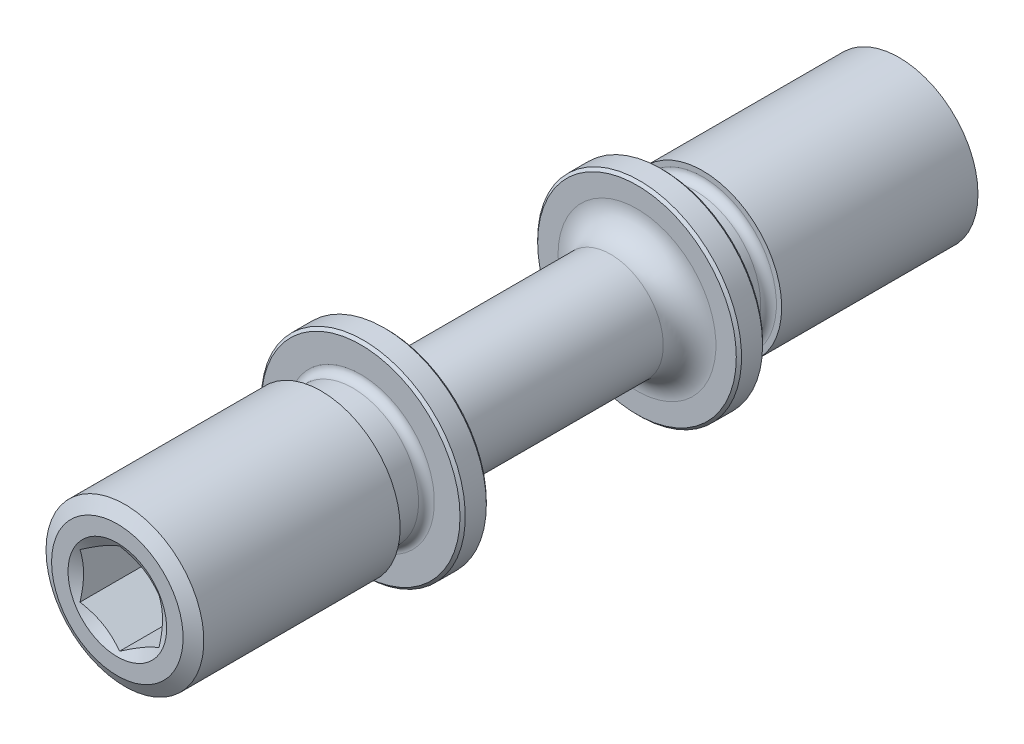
ISO-10303-21;
HEADER;
FILE_DESCRIPTION(('STEP AP214'),'2;1');
FILE_NAME('part.step','',(''),(''),'','','');
FILE_SCHEMA(('AUTOMOTIVE_DESIGN { 1 0 10303 214 1 1 1 1 }'));
ENDSEC;
DATA;
#1=APPLICATION_CONTEXT('core data for automotive mechanical design processes');
#2=APPLICATION_PROTOCOL_DEFINITION('international standard','automotive_design',2000,#1);
#3=PRODUCT_CONTEXT('',#1,'mechanical');
#4=PRODUCT('Part','Part','',(#3));
#5=PRODUCT_RELATED_PRODUCT_CATEGORY('part','',(#4));
#6=PRODUCT_DEFINITION_FORMATION('','',#4);
#7=PRODUCT_DEFINITION_CONTEXT('part definition',#1,'design');
#8=PRODUCT_DEFINITION('design','',#6,#7);
#9=PRODUCT_DEFINITION_SHAPE('','',#8);
#10=(LENGTH_UNIT() NAMED_UNIT(*) SI_UNIT(.MILLI.,.METRE.));
#11=(NAMED_UNIT(*) PLANE_ANGLE_UNIT() SI_UNIT($,.RADIAN.));
#12=(NAMED_UNIT(*) SI_UNIT($,.STERADIAN.) SOLID_ANGLE_UNIT());
#13=UNCERTAINTY_MEASURE_WITH_UNIT(LENGTH_MEASURE(1.E-05),#10,'distance_accuracy_value','');
#14=(GEOMETRIC_REPRESENTATION_CONTEXT(3) GLOBAL_UNCERTAINTY_ASSIGNED_CONTEXT((#13)) GLOBAL_UNIT_ASSIGNED_CONTEXT((#10,
#11,#12)) REPRESENTATION_CONTEXT('',''));
#15=CARTESIAN_POINT('',(0.,0.,0.));
#16=DIRECTION('',(0.,0.,1.));
#17=DIRECTION('',(1.,0.,0.));
#18=AXIS2_PLACEMENT_3D('',#15,#16,#17);
#19=CARTESIAN_POINT('',(0.,0.,30.));
#20=DIRECTION('',(0.,0.,-1.));
#21=DIRECTION('',(-1.,0.,0.));
#22=AXIS2_PLACEMENT_3D('',#19,#20,#21);
#23=PLANE('',#22);
#24=CARTESIAN_POINT('',(0.,0.,30.));
#25=DIRECTION('',(0.,0.,-1.));
#26=DIRECTION('',(-1.,0.,0.));
#27=AXIS2_PLACEMENT_3D('',#24,#25,#26);
#28=CIRCLE('',#27,5.);
#29=CARTESIAN_POINT('',(-5.,0.,30.));
#30=VERTEX_POINT('',#29);
#31=EDGE_CURVE('E98',#30,#30,#28,.F.);
#32=ORIENTED_EDGE('',*,*,#31,.T.);
#33=EDGE_LOOP('',(#32));
#34=FACE_BOUND('',#33,.T.);
#35=CARTESIAN_POINT('',(0.,0.,30.));
#36=DIRECTION('',(0.,0.,-1.));
#37=DIRECTION('',(-1.,0.,0.));
#38=AXIS2_PLACEMENT_3D('',#35,#36,#37);
#39=CIRCLE('',#38,3.75);
#40=CARTESIAN_POINT('',(-3.75,0.,30.));
#41=VERTEX_POINT('',#40);
#42=EDGE_CURVE('E73',#41,#41,#39,.T.);
#43=ORIENTED_EDGE('',*,*,#42,.T.);
#44=EDGE_LOOP('',(#43));
#45=FACE_BOUND('',#44,.T.);
#46=ADVANCED_FACE('F14',(#34,#45),#23,.F.);
#47=CARTESIAN_POINT('',(0.,4.,9.5));
#48=DIRECTION('',(0.,0.,1.));
#49=DIRECTION('',(1.,0.,0.));
#50=AXIS2_PLACEMENT_3D('',#47,#48,#49);
#51=PLANE('',#50);
#52=CARTESIAN_POINT('',(0.,0.,9.5));
#53=DIRECTION('',(0.,0.,1.));
#54=DIRECTION('',(1.,0.,0.));
#55=AXIS2_PLACEMENT_3D('',#52,#53,#54);
#56=CIRCLE('',#55,7.55);
#57=CARTESIAN_POINT('',(7.55,0.,9.5));
#58=VERTEX_POINT('',#57);
#59=EDGE_CURVE('E9',#58,#58,#56,.F.);
#60=ORIENTED_EDGE('',*,*,#59,.T.);
#61=EDGE_LOOP('',(#60));
#62=FACE_BOUND('',#61,.T.);
#63=CARTESIAN_POINT('',(0.,0.,9.5));
#64=DIRECTION('',(0.,0.,1.));
#65=DIRECTION('',(1.,0.,0.));
#66=AXIS2_PLACEMENT_3D('',#63,#64,#65);
#67=CIRCLE('',#66,6.);
#68=CARTESIAN_POINT('',(6.,0.,9.5));
#69=VERTEX_POINT('',#68);
#70=EDGE_CURVE('E137',#69,#69,#67,.T.);
#71=ORIENTED_EDGE('',*,*,#70,.T.);
#72=EDGE_LOOP('',(#71));
#73=FACE_BOUND('',#72,.T.);
#74=ADVANCED_FACE('F183',(#62,#73),#51,.F.);
#75=CARTESIAN_POINT('',(0.,0.,30.));
#76=DIRECTION('',(0.,0.,-1.));
#77=DIRECTION('',(-1.,0.,0.));
#78=AXIS2_PLACEMENT_3D('',#75,#76,#77);
#79=CYLINDRICAL_SURFACE('',#78,4.);
#80=CARTESIAN_POINT('',(0.,0.,7.5));
#81=DIRECTION('',(0.,0.,1.));
#82=DIRECTION('',(1.,0.,0.));
#83=AXIS2_PLACEMENT_3D('',#80,#81,#82);
#84=CIRCLE('',#83,4.);
#85=CARTESIAN_POINT('',(4.,0.,7.5));
#86=VERTEX_POINT('',#85);
#87=EDGE_CURVE('E134',#86,#86,#84,.F.);
#88=ORIENTED_EDGE('',*,*,#87,.T.);
#89=EDGE_LOOP('',(#88));
#90=FACE_BOUND('',#89,.T.);
#91=CARTESIAN_POINT('',(0.,0.,-7.5));
#92=DIRECTION('',(0.,0.,-1.));
#93=DIRECTION('',(-1.,0.,0.));
#94=AXIS2_PLACEMENT_3D('',#91,#92,#93);
#95=CIRCLE('',#94,4.);
#96=CARTESIAN_POINT('',(-4.,0.,-7.5));
#97=VERTEX_POINT('',#96);
#98=EDGE_CURVE('E131',#97,#97,#95,.F.);
#99=ORIENTED_EDGE('',*,*,#98,.T.);
#100=EDGE_LOOP('',(#99));
#101=FACE_BOUND('',#100,.T.);
#102=ADVANCED_FACE('F186',(#90,#101),#79,.T.);
#103=CARTESIAN_POINT('',(0.,6.,-9.5));
#104=DIRECTION('',(0.,0.,-1.));
#105=DIRECTION('',(-1.,0.,0.));
#106=AXIS2_PLACEMENT_3D('',#103,#104,#105);
#107=PLANE('',#106);
#108=CARTESIAN_POINT('',(0.,0.,-9.5));
#109=DIRECTION('',(0.,0.,-1.));
#110=DIRECTION('',(-1.,0.,0.));
#111=AXIS2_PLACEMENT_3D('',#108,#109,#110);
#112=CIRCLE('',#111,7.55);
#113=CARTESIAN_POINT('',(-7.55,0.,-9.5));
#114=VERTEX_POINT('',#113);
#115=EDGE_CURVE('E152',#114,#114,#112,.F.);
#116=ORIENTED_EDGE('',*,*,#115,.T.);
#117=EDGE_LOOP('',(#116));
#118=FACE_BOUND('',#117,.T.);
#119=CARTESIAN_POINT('',(0.,0.,-9.5));
#120=DIRECTION('',(0.,0.,-1.));
#121=DIRECTION('',(-1.,0.,0.));
#122=AXIS2_PLACEMENT_3D('',#119,#120,#121);
#123=CIRCLE('',#122,6.);
#124=CARTESIAN_POINT('',(-6.,0.,-9.5));
#125=VERTEX_POINT('',#124);
#126=EDGE_CURVE('E140',#125,#125,#123,.T.);
#127=ORIENTED_EDGE('',*,*,#126,.T.);
#128=EDGE_LOOP('',(#127));
#129=FACE_BOUND('',#128,.T.);
#130=ADVANCED_FACE('F175',(#118,#129),#107,.F.);
#131=CARTESIAN_POINT('',(0.,0.,30.));
#132=DIRECTION('',(0.,0.,-1.));
#133=DIRECTION('',(-1.,0.,0.));
#134=AXIS2_PLACEMENT_3D('',#131,#132,#133);
#135=CYLINDRICAL_SURFACE('',#134,7.75);
#136=CARTESIAN_POINT('',(0.,0.,11.3));
#137=DIRECTION('',(0.,0.,-1.));
#138=DIRECTION('',(-1.,0.,0.));
#139=AXIS2_PLACEMENT_3D('',#136,#137,#138);
#140=CIRCLE('',#139,7.75);
#141=CARTESIAN_POINT('',(-7.75,0.,11.3));
#142=VERTEX_POINT('',#141);
#143=EDGE_CURVE('E158',#142,#142,#140,.T.);
#144=ORIENTED_EDGE('',*,*,#143,.T.);
#145=EDGE_LOOP('',(#144));
#146=FACE_BOUND('',#145,.T.);
#147=CARTESIAN_POINT('',(0.,0.,9.7));
#148=DIRECTION('',(0.,0.,1.));
#149=DIRECTION('',(1.,0.,0.));
#150=AXIS2_PLACEMENT_3D('',#147,#148,#149);
#151=CIRCLE('',#150,7.75);
#152=CARTESIAN_POINT('',(7.75,0.,9.7));
#153=VERTEX_POINT('',#152);
#154=EDGE_CURVE('E155',#153,#153,#151,.T.);
#155=ORIENTED_EDGE('',*,*,#154,.T.);
#156=EDGE_LOOP('',(#155));
#157=FACE_BOUND('',#156,.T.);
#158=ADVANCED_FACE('F172',(#146,#157),#135,.T.);
#159=CARTESIAN_POINT('',(0.,6.,11.5));
#160=DIRECTION('',(0.,0.,-1.));
#161=DIRECTION('',(-1.,0.,0.));
#162=AXIS2_PLACEMENT_3D('',#159,#160,#161);
#163=PLANE('',#162);
#164=CARTESIAN_POINT('',(0.,0.,11.5));
#165=DIRECTION('',(0.,0.,-1.));
#166=DIRECTION('',(-1.,0.,0.));
#167=AXIS2_PLACEMENT_3D('',#164,#165,#166);
#168=CIRCLE('',#167,7.55);
#169=CARTESIAN_POINT('',(-7.55,0.,11.5));
#170=VERTEX_POINT('',#169);
#171=EDGE_CURVE('E22',#170,#170,#168,.F.);
#172=ORIENTED_EDGE('',*,*,#171,.T.);
#173=EDGE_LOOP('',(#172));
#174=FACE_BOUND('',#173,.T.);
#175=CARTESIAN_POINT('',(0.,0.,11.5));
#176=DIRECTION('',(0.,0.,-1.));
#177=DIRECTION('',(-1.,0.,0.));
#178=AXIS2_PLACEMENT_3D('',#175,#176,#177);
#179=CIRCLE('',#178,5.6);
#180=CARTESIAN_POINT('',(-5.6,0.,11.5));
#181=VERTEX_POINT('',#180);
#182=EDGE_CURVE('E116',#181,#181,#179,.T.);
#183=ORIENTED_EDGE('',*,*,#182,.T.);
#184=EDGE_LOOP('',(#183));
#185=FACE_BOUND('',#184,.T.);
#186=ADVANCED_FACE('F163',(#174,#185),#163,.F.);
#187=CARTESIAN_POINT('',(0.,0.,30.));
#188=DIRECTION('',(0.,0.,-1.));
#189=DIRECTION('',(-1.,0.,0.));
#190=AXIS2_PLACEMENT_3D('',#187,#188,#189);
#191=CYLINDRICAL_SURFACE('',#190,7.75);
#192=CARTESIAN_POINT('',(0.,0.,-11.3));
#193=DIRECTION('',(0.,0.,1.));
#194=DIRECTION('',(1.,0.,0.));
#195=AXIS2_PLACEMENT_3D('',#192,#193,#194);
#196=CIRCLE('',#195,7.75);
#197=CARTESIAN_POINT('',(7.75,0.,-11.3));
#198=VERTEX_POINT('',#197);
#199=EDGE_CURVE('E149',#198,#198,#196,.T.);
#200=ORIENTED_EDGE('',*,*,#199,.T.);
#201=EDGE_LOOP('',(#200));
#202=FACE_BOUND('',#201,.T.);
#203=CARTESIAN_POINT('',(0.,0.,-9.7));
#204=DIRECTION('',(0.,0.,-1.));
#205=DIRECTION('',(-1.,0.,0.));
#206=AXIS2_PLACEMENT_3D('',#203,#204,#205);
#207=CIRCLE('',#206,7.75);
#208=CARTESIAN_POINT('',(-7.75,0.,-9.7));
#209=VERTEX_POINT('',#208);
#210=EDGE_CURVE('E146',#209,#209,#207,.T.);
#211=ORIENTED_EDGE('',*,*,#210,.T.);
#212=EDGE_LOOP('',(#211));
#213=FACE_BOUND('',#212,.T.);
#214=ADVANCED_FACE('F265',(#202,#213),#191,.T.);
#215=CARTESIAN_POINT('',(0.,6.,-11.5));
#216=DIRECTION('',(0.,0.,1.));
#217=DIRECTION('',(1.,0.,0.));
#218=AXIS2_PLACEMENT_3D('',#215,#216,#217);
#219=PLANE('',#218);
#220=CARTESIAN_POINT('',(0.,0.,-11.5));
#221=DIRECTION('',(0.,0.,1.));
#222=DIRECTION('',(1.,0.,0.));
#223=AXIS2_PLACEMENT_3D('',#220,#221,#222);
#224=CIRCLE('',#223,7.55);
#225=CARTESIAN_POINT('',(7.55,0.,-11.5));
#226=VERTEX_POINT('',#225);
#227=EDGE_CURVE('E143',#226,#226,#224,.F.);
#228=ORIENTED_EDGE('',*,*,#227,.T.);
#229=EDGE_LOOP('',(#228));
#230=FACE_BOUND('',#229,.T.);
#231=CARTESIAN_POINT('',(0.,0.,-11.5));
#232=DIRECTION('',(0.,0.,1.));
#233=DIRECTION('',(1.,0.,0.));
#234=AXIS2_PLACEMENT_3D('',#231,#232,#233);
#235=CIRCLE('',#234,5.6);
#236=CARTESIAN_POINT('',(5.6,0.,-11.5));
#237=VERTEX_POINT('',#236);
#238=EDGE_CURVE('E119',#237,#237,#235,.T.);
#239=ORIENTED_EDGE('',*,*,#238,.T.);
#240=EDGE_LOOP('',(#239));
#241=FACE_BOUND('',#240,.T.);
#242=ADVANCED_FACE('F267',(#230,#241),#219,.F.);
#243=CARTESIAN_POINT('',(0.,0.,30.));
#244=DIRECTION('',(0.,0.,1.));
#245=DIRECTION('',(1.,0.,0.));
#246=AXIS2_PLACEMENT_3D('',#243,#244,#245);
#247=CYLINDRICAL_SURFACE('',#246,5.);
#248=CARTESIAN_POINT('',(0.,0.,13.9));
#249=DIRECTION('',(0.,0.,1.));
#250=DIRECTION('',(1.,0.,0.));
#251=AXIS2_PLACEMENT_3D('',#248,#249,#250);
#252=CIRCLE('',#251,5.);
#253=CARTESIAN_POINT('',(5.,0.,13.9));
#254=VERTEX_POINT('',#253);
#255=EDGE_CURVE('E113',#254,#254,#252,.F.);
#256=ORIENTED_EDGE('',*,*,#255,.T.);
#257=EDGE_LOOP('',(#256));
#258=FACE_BOUND('',#257,.T.);
#259=CARTESIAN_POINT('',(0.,0.,12.1));
#260=DIRECTION('',(0.,0.,-1.));
#261=DIRECTION('',(-1.,0.,0.));
#262=AXIS2_PLACEMENT_3D('',#259,#260,#261);
#263=CIRCLE('',#262,5.);
#264=CARTESIAN_POINT('',(-5.,0.,12.1));
#265=VERTEX_POINT('',#264);
#266=EDGE_CURVE('E110',#265,#265,#263,.F.);
#267=ORIENTED_EDGE('',*,*,#266,.T.);
#268=EDGE_LOOP('',(#267));
#269=FACE_BOUND('',#268,.T.);
#270=ADVANCED_FACE('F275',(#258,#269),#247,.T.);
#271=CARTESIAN_POINT('',(0.,6.,14.5));
#272=DIRECTION('',(0.,0.,1.));
#273=DIRECTION('',(1.,0.,0.));
#274=AXIS2_PLACEMENT_3D('',#271,#272,#273);
#275=PLANE('',#274);
#276=CARTESIAN_POINT('',(0.,0.,14.5));
#277=DIRECTION('',(0.,0.,1.));
#278=DIRECTION('',(1.,0.,0.));
#279=AXIS2_PLACEMENT_3D('',#276,#277,#278);
#280=CIRCLE('',#279,5.6);
#281=CARTESIAN_POINT('',(5.6,0.,14.5));
#282=VERTEX_POINT('',#281);
#283=EDGE_CURVE('E107',#282,#282,#280,.T.);
#284=ORIENTED_EDGE('',*,*,#283,.T.);
#285=EDGE_LOOP('',(#284));
#286=FACE_BOUND('',#285,.T.);
#287=CARTESIAN_POINT('',(0.,0.,14.5));
#288=DIRECTION('',(0.,0.,1.));
#289=DIRECTION('',(1.,0.,0.));
#290=AXIS2_PLACEMENT_3D('',#287,#288,#289);
#291=CIRCLE('',#290,6.);
#292=CARTESIAN_POINT('',(6.,0.,14.5));
#293=VERTEX_POINT('',#292);
#294=EDGE_CURVE('E367',#293,#293,#291,.T.);
#295=ORIENTED_EDGE('',*,*,#294,.F.);
#296=EDGE_LOOP('',(#295));
#297=FACE_BOUND('',#296,.T.);
#298=ADVANCED_FACE('F230',(#286,#297),#275,.F.);
#299=CARTESIAN_POINT('',(0.,0.,29.4226497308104));
#300=DIRECTION('',(0.,0.,-1.));
#301=DIRECTION('',(-1.,0.,0.));
#302=AXIS2_PLACEMENT_3D('',#299,#300,#301);
#303=CONICAL_SURFACE('',#302,6.,1.0471975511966);
#304=ORIENTED_EDGE('',*,*,#31,.F.);
#305=EDGE_LOOP('',(#304));
#306=FACE_BOUND('',#305,.T.);
#307=CARTESIAN_POINT('',(0.,0.,29.4226497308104));
#308=DIRECTION('',(0.,0.,-1.));
#309=DIRECTION('',(-1.,0.,0.));
#310=AXIS2_PLACEMENT_3D('',#307,#308,#309);
#311=CIRCLE('',#310,6.);
#312=CARTESIAN_POINT('',(-6.,0.,29.4226497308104));
#313=VERTEX_POINT('',#312);
#314=EDGE_CURVE('E95',#313,#313,#311,.T.);
#315=ORIENTED_EDGE('',*,*,#314,.F.);
#316=EDGE_LOOP('',(#315));
#317=FACE_BOUND('',#316,.T.);
#318=ADVANCED_FACE('F227',(#306,#317),#303,.T.);
#319=CARTESIAN_POINT('',(0.,0.,30.));
#320=DIRECTION('',(0.,0.,-1.));
#321=DIRECTION('',(-1.,0.,0.));
#322=AXIS2_PLACEMENT_3D('',#319,#320,#321);
#323=CYLINDRICAL_SURFACE('',#322,6.);
#324=ORIENTED_EDGE('',*,*,#294,.T.);
#325=EDGE_LOOP('',(#324));
#326=FACE_BOUND('',#325,.T.);
#327=ORIENTED_EDGE('',*,*,#314,.T.);
#328=EDGE_LOOP('',(#327));
#329=FACE_BOUND('',#328,.T.);
#330=ADVANCED_FACE('F226',(#326,#329),#323,.T.);
#331=CARTESIAN_POINT('',(0.,0.,30.));
#332=DIRECTION('',(0.,0.,1.));
#333=DIRECTION('',(1.,0.,0.));
#334=AXIS2_PLACEMENT_3D('',#331,#332,#333);
#335=CYLINDRICAL_SURFACE('',#334,5.);
#336=CARTESIAN_POINT('',(0.,0.,-12.1));
#337=DIRECTION('',(0.,0.,1.));
#338=DIRECTION('',(1.,0.,0.));
#339=AXIS2_PLACEMENT_3D('',#336,#337,#338);
#340=CIRCLE('',#339,5.);
#341=CARTESIAN_POINT('',(5.,0.,-12.1));
#342=VERTEX_POINT('',#341);
#343=EDGE_CURVE('E125',#342,#342,#340,.F.);
#344=ORIENTED_EDGE('',*,*,#343,.T.);
#345=EDGE_LOOP('',(#344));
#346=FACE_BOUND('',#345,.T.);
#347=CARTESIAN_POINT('',(0.,0.,-13.9));
#348=DIRECTION('',(0.,0.,-1.));
#349=DIRECTION('',(-1.,0.,0.));
#350=AXIS2_PLACEMENT_3D('',#347,#348,#349);
#351=CIRCLE('',#350,5.);
#352=CARTESIAN_POINT('',(-5.,0.,-13.9));
#353=VERTEX_POINT('',#352);
#354=EDGE_CURVE('E122',#353,#353,#351,.F.);
#355=ORIENTED_EDGE('',*,*,#354,.T.);
#356=EDGE_LOOP('',(#355));
#357=FACE_BOUND('',#356,.T.);
#358=ADVANCED_FACE('F546',(#346,#357),#335,.T.);
#359=CARTESIAN_POINT('',(0.,6.,-14.5));
#360=DIRECTION('',(0.,0.,-1.));
#361=DIRECTION('',(-1.,0.,0.));
#362=AXIS2_PLACEMENT_3D('',#359,#360,#361);
#363=PLANE('',#362);
#364=CARTESIAN_POINT('',(0.,0.,-14.5));
#365=DIRECTION('',(0.,0.,-1.));
#366=DIRECTION('',(-1.,0.,0.));
#367=AXIS2_PLACEMENT_3D('',#364,#365,#366);
#368=CIRCLE('',#367,5.6);
#369=CARTESIAN_POINT('',(-5.6,0.,-14.5));
#370=VERTEX_POINT('',#369);
#371=EDGE_CURVE('E128',#370,#370,#368,.T.);
#372=ORIENTED_EDGE('',*,*,#371,.T.);
#373=EDGE_LOOP('',(#372));
#374=FACE_BOUND('',#373,.T.);
#375=CARTESIAN_POINT('',(0.,0.,-14.5));
#376=DIRECTION('',(0.,0.,1.));
#377=DIRECTION('',(1.,0.,0.));
#378=AXIS2_PLACEMENT_3D('',#375,#376,#377);
#379=CIRCLE('',#378,6.);
#380=CARTESIAN_POINT('',(6.,0.,-14.5));
#381=VERTEX_POINT('',#380);
#382=EDGE_CURVE('E362',#381,#381,#379,.T.);
#383=ORIENTED_EDGE('',*,*,#382,.T.);
#384=EDGE_LOOP('',(#383));
#385=FACE_BOUND('',#384,.T.);
#386=ADVANCED_FACE('F314',(#374,#385),#363,.F.);
#387=CARTESIAN_POINT('',(0.,0.,-30.));
#388=DIRECTION('',(0.,0.,1.));
#389=DIRECTION('',(1.,0.,0.));
#390=AXIS2_PLACEMENT_3D('',#387,#388,#389);
#391=PLANE('',#390);
#392=CARTESIAN_POINT('',(0.,0.,-30.));
#393=DIRECTION('',(0.,0.,1.));
#394=DIRECTION('',(1.,0.,0.));
#395=AXIS2_PLACEMENT_3D('',#392,#393,#394);
#396=CIRCLE('',#395,5.);
#397=CARTESIAN_POINT('',(5.,0.,-30.));
#398=VERTEX_POINT('',#397);
#399=EDGE_CURVE('E101',#398,#398,#396,.F.);
#400=ORIENTED_EDGE('',*,*,#399,.T.);
#401=EDGE_LOOP('',(#400));
#402=FACE_BOUND('',#401,.T.);
#403=ADVANCED_FACE('F236',(#402),#391,.F.);
#404=CARTESIAN_POINT('',(0.,0.,-30.));
#405=DIRECTION('',(0.,0.,1.));
#406=DIRECTION('',(1.,0.,0.));
#407=AXIS2_PLACEMENT_3D('',#404,#405,#406);
#408=CONICAL_SURFACE('',#407,5.,1.0471975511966);
#409=CARTESIAN_POINT('',(0.,0.,-29.4226497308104));
#410=DIRECTION('',(0.,0.,1.));
#411=DIRECTION('',(1.,0.,0.));
#412=AXIS2_PLACEMENT_3D('',#409,#410,#411);
#413=CIRCLE('',#412,6.);
#414=CARTESIAN_POINT('',(6.,0.,-29.4226497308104));
#415=VERTEX_POINT('',#414);
#416=EDGE_CURVE('E104',#415,#415,#413,.T.);
#417=ORIENTED_EDGE('',*,*,#416,.F.);
#418=EDGE_LOOP('',(#417));
#419=FACE_BOUND('',#418,.T.);
#420=ORIENTED_EDGE('',*,*,#399,.F.);
#421=EDGE_LOOP('',(#420));
#422=FACE_BOUND('',#421,.T.);
#423=ADVANCED_FACE('F232',(#419,#422),#408,.T.);
#424=CARTESIAN_POINT('',(0.,0.,30.));
#425=DIRECTION('',(0.,0.,-1.));
#426=DIRECTION('',(-1.,0.,0.));
#427=AXIS2_PLACEMENT_3D('',#424,#425,#426);
#428=CYLINDRICAL_SURFACE('',#427,6.);
#429=ORIENTED_EDGE('',*,*,#382,.F.);
#430=EDGE_LOOP('',(#429));
#431=FACE_BOUND('',#430,.T.);
#432=ORIENTED_EDGE('',*,*,#416,.T.);
#433=EDGE_LOOP('',(#432));
#434=FACE_BOUND('',#433,.T.);
#435=ADVANCED_FACE('F235',(#431,#434),#428,.T.);
#436=CARTESIAN_POINT('',(0.,0.,13.9));
#437=DIRECTION('',(0.,0.,1.));
#438=DIRECTION('',(1.,0.,0.));
#439=AXIS2_PLACEMENT_3D('',#436,#437,#438);
#440=TOROIDAL_SURFACE('',#439,5.6,0.6);
#441=ORIENTED_EDGE('',*,*,#255,.F.);
#442=EDGE_LOOP('',(#441));
#443=FACE_BOUND('',#442,.T.);
#444=ORIENTED_EDGE('',*,*,#283,.F.);
#445=EDGE_LOOP('',(#444));
#446=FACE_BOUND('',#445,.T.);
#447=ADVANCED_FACE('F238',(#443,#446),#440,.F.);
#448=CARTESIAN_POINT('',(0.,0.,12.1));
#449=DIRECTION('',(0.,0.,-1.));
#450=DIRECTION('',(-1.,0.,0.));
#451=AXIS2_PLACEMENT_3D('',#448,#449,#450);
#452=TOROIDAL_SURFACE('',#451,5.6,0.6);
#453=ORIENTED_EDGE('',*,*,#182,.F.);
#454=EDGE_LOOP('',(#453));
#455=FACE_BOUND('',#454,.T.);
#456=ORIENTED_EDGE('',*,*,#266,.F.);
#457=EDGE_LOOP('',(#456));
#458=FACE_BOUND('',#457,.T.);
#459=ADVANCED_FACE('F241',(#455,#458),#452,.F.);
#460=CARTESIAN_POINT('',(0.,0.,-12.1));
#461=DIRECTION('',(0.,0.,1.));
#462=DIRECTION('',(1.,0.,0.));
#463=AXIS2_PLACEMENT_3D('',#460,#461,#462);
#464=TOROIDAL_SURFACE('',#463,5.6,0.6);
#465=ORIENTED_EDGE('',*,*,#343,.F.);
#466=EDGE_LOOP('',(#465));
#467=FACE_BOUND('',#466,.T.);
#468=ORIENTED_EDGE('',*,*,#238,.F.);
#469=EDGE_LOOP('',(#468));
#470=FACE_BOUND('',#469,.T.);
#471=ADVANCED_FACE('F245',(#467,#470),#464,.F.);
#472=CARTESIAN_POINT('',(0.,0.,-13.9));
#473=DIRECTION('',(0.,0.,-1.));
#474=DIRECTION('',(-1.,0.,0.));
#475=AXIS2_PLACEMENT_3D('',#472,#473,#474);
#476=TOROIDAL_SURFACE('',#475,5.6,0.6);
#477=ORIENTED_EDGE('',*,*,#371,.F.);
#478=EDGE_LOOP('',(#477));
#479=FACE_BOUND('',#478,.T.);
#480=ORIENTED_EDGE('',*,*,#354,.F.);
#481=EDGE_LOOP('',(#480));
#482=FACE_BOUND('',#481,.T.);
#483=ADVANCED_FACE('F194',(#479,#482),#476,.F.);
#484=CARTESIAN_POINT('',(0.,0.,7.5));
#485=DIRECTION('',(0.,0.,1.));
#486=DIRECTION('',(1.,0.,0.));
#487=AXIS2_PLACEMENT_3D('',#484,#485,#486);
#488=TOROIDAL_SURFACE('',#487,6.,2.);
#489=ORIENTED_EDGE('',*,*,#70,.F.);
#490=EDGE_LOOP('',(#489));
#491=FACE_BOUND('',#490,.T.);
#492=ORIENTED_EDGE('',*,*,#87,.F.);
#493=EDGE_LOOP('',(#492));
#494=FACE_BOUND('',#493,.T.);
#495=ADVANCED_FACE('F190',(#491,#494),#488,.F.);
#496=CARTESIAN_POINT('',(0.,0.,-7.5));
#497=DIRECTION('',(0.,0.,-1.));
#498=DIRECTION('',(-1.,0.,0.));
#499=AXIS2_PLACEMENT_3D('',#496,#497,#498);
#500=TOROIDAL_SURFACE('',#499,6.,2.);
#501=ORIENTED_EDGE('',*,*,#98,.F.);
#502=EDGE_LOOP('',(#501));
#503=FACE_BOUND('',#502,.T.);
#504=ORIENTED_EDGE('',*,*,#126,.F.);
#505=EDGE_LOOP('',(#504));
#506=FACE_BOUND('',#505,.T.);
#507=ADVANCED_FACE('F193',(#503,#506),#500,.F.);
#508=CARTESIAN_POINT('',(0.,0.,-11.5));
#509=DIRECTION('',(0.,0.,1.));
#510=DIRECTION('',(1.,0.,0.));
#511=AXIS2_PLACEMENT_3D('',#508,#509,#510);
#512=CONICAL_SURFACE('',#511,7.55,0.785398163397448);
#513=ORIENTED_EDGE('',*,*,#199,.F.);
#514=EDGE_LOOP('',(#513));
#515=FACE_BOUND('',#514,.T.);
#516=ORIENTED_EDGE('',*,*,#227,.F.);
#517=EDGE_LOOP('',(#516));
#518=FACE_BOUND('',#517,.T.);
#519=ADVANCED_FACE('F205',(#515,#518),#512,.T.);
#520=CARTESIAN_POINT('',(0.,0.,-9.7));
#521=DIRECTION('',(0.,0.,-1.));
#522=DIRECTION('',(-1.,0.,0.));
#523=AXIS2_PLACEMENT_3D('',#520,#521,#522);
#524=CONICAL_SURFACE('',#523,7.75,0.785398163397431);
#525=ORIENTED_EDGE('',*,*,#115,.F.);
#526=EDGE_LOOP('',(#525));
#527=FACE_BOUND('',#526,.T.);
#528=ORIENTED_EDGE('',*,*,#210,.F.);
#529=EDGE_LOOP('',(#528));
#530=FACE_BOUND('',#529,.T.);
#531=ADVANCED_FACE('F169',(#527,#530),#524,.T.);
#532=CARTESIAN_POINT('',(0.,0.,11.3));
#533=DIRECTION('',(0.,0.,-1.));
#534=DIRECTION('',(-1.,0.,0.));
#535=AXIS2_PLACEMENT_3D('',#532,#533,#534);
#536=CONICAL_SURFACE('',#535,7.75,0.785398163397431);
#537=ORIENTED_EDGE('',*,*,#171,.F.);
#538=EDGE_LOOP('',(#537));
#539=FACE_BOUND('',#538,.T.);
#540=ORIENTED_EDGE('',*,*,#143,.F.);
#541=EDGE_LOOP('',(#540));
#542=FACE_BOUND('',#541,.T.);
#543=ADVANCED_FACE('F166',(#539,#542),#536,.T.);
#544=CARTESIAN_POINT('',(0.,0.,9.5));
#545=DIRECTION('',(0.,0.,1.));
#546=DIRECTION('',(1.,0.,0.));
#547=AXIS2_PLACEMENT_3D('',#544,#545,#546);
#548=CONICAL_SURFACE('',#547,7.55,0.785398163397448);
#549=ORIENTED_EDGE('',*,*,#154,.F.);
#550=EDGE_LOOP('',(#549));
#551=FACE_BOUND('',#550,.T.);
#552=ORIENTED_EDGE('',*,*,#59,.F.);
#553=EDGE_LOOP('',(#552));
#554=FACE_BOUND('',#553,.T.);
#555=ADVANCED_FACE('F16',(#551,#554),#548,.T.);
#556=CARTESIAN_POINT('',(0.,0.,30.));
#557=DIRECTION('',(0.,0.,1.));
#558=DIRECTION('',(1.,0.,0.));
#559=AXIS2_PLACEMENT_3D('',#556,#557,#558);
#560=CONICAL_SURFACE('',#559,3.75,1.0471975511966);
#561=ORIENTED_EDGE('',*,*,#42,.F.);
#562=EDGE_LOOP('',(#561));
#563=FACE_BOUND('',#562,.T.);
#564=CARTESIAN_POINT('',(-3.,-4.57256787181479,30.9923814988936));
#565=CARTESIAN_POINT('',(-3.,-4.44215116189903,30.9294435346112));
#566=CARTESIAN_POINT('',(-3.,-4.31142624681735,30.867132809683));
#567=CARTESIAN_POINT('',(-3.,-4.04919570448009,30.7441204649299));
#568=CARTESIAN_POINT('',(-3.,-3.91768995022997,30.6834191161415));
#569=CARTESIAN_POINT('',(-3.,-3.65301698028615,30.5636575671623));
#570=CARTESIAN_POINT('',(-3.,-3.51984455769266,30.5046088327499));
#571=CARTESIAN_POINT('',(-3.,-3.25241164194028,30.3890384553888));
#572=CARTESIAN_POINT('',(-3.,-3.11815120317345,30.3325166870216));
#573=CARTESIAN_POINT('',(-3.,-2.844389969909,30.2210669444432));
#574=CARTESIAN_POINT('',(-3.,-2.70485049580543,30.1662334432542));
#575=CARTESIAN_POINT('',(-3.,-2.42410999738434,30.0609134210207));
#576=CARTESIAN_POINT('',(-3.,-2.28290878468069,30.0104273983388));
#577=CARTESIAN_POINT('',(-3.,-1.9989111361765,29.9151860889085));
#578=CARTESIAN_POINT('',(-3.,-1.85611887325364,29.8704184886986));
#579=CARTESIAN_POINT('',(-3.,-1.56848893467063,29.7881024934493));
#580=CARTESIAN_POINT('',(-3.,-1.42365194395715,29.750551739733));
#581=CARTESIAN_POINT('',(-3.,-1.1325995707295,29.6847083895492));
#582=CARTESIAN_POINT('',(-3.,-0.986394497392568,29.6563710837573));
#583=CARTESIAN_POINT('',(-3.,-0.69225401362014,29.6106239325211));
#584=CARTESIAN_POINT('',(-3.,-0.544318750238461,29.5932131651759));
#585=CARTESIAN_POINT('',(-3.,-0.249354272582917,29.5709367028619));
#586=CARTESIAN_POINT('',(-3.,-0.102337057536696,29.565916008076));
#587=CARTESIAN_POINT('',(-3.,0.191600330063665,29.5684419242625));
#588=CARTESIAN_POINT('',(-3.,0.338520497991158,29.5759890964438));
#589=CARTESIAN_POINT('',(-3.,0.590333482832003,29.5991741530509));
#590=CARTESIAN_POINT('',(-3.,0.695502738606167,29.611963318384));
#591=CARTESIAN_POINT('',(-3.,0.905013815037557,29.6431410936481));
#592=CARTESIAN_POINT('',(-3.,1.00935551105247,29.6615305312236));
#593=CARTESIAN_POINT('',(-3.,1.32102867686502,29.7241263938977));
#594=CARTESIAN_POINT('',(-3.,1.52688448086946,29.7757475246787));
#595=CARTESIAN_POINT('',(-3.,1.83471221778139,29.8645533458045));
#596=CARTESIAN_POINT('',(-3.,1.93829465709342,29.8964669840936));
#597=CARTESIAN_POINT('',(-3.,2.14445186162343,29.9634266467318));
#598=CARTESIAN_POINT('',(-3.,2.2470266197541,29.9984726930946));
#599=CARTESIAN_POINT('',(-3.,2.45120582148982,30.071149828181));
#600=CARTESIAN_POINT('',(-3.,2.55281060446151,30.1087799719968));
#601=CARTESIAN_POINT('',(-3.,2.75518941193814,30.186200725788));
#602=CARTESIAN_POINT('',(-3.,2.85596344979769,30.2259913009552));
#603=CARTESIAN_POINT('',(-3.,3.11003131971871,30.3289486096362));
#604=CARTESIAN_POINT('',(-3.,3.26283572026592,30.3933214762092));
#605=CARTESIAN_POINT('',(-3.,3.56705579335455,30.5252789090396));
#606=CARTESIAN_POINT('',(-3.,3.71847135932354,30.5928637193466));
#607=CARTESIAN_POINT('',(-3.,4.02020243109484,30.7305353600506));
#608=CARTESIAN_POINT('',(-3.,4.17051765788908,30.8006228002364));
#609=CARTESIAN_POINT('',(-3.,4.47022149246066,30.9427547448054));
#610=CARTESIAN_POINT('',(-3.,4.61961007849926,31.0147992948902));
#611=CARTESIAN_POINT('',(-3.,5.0670035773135,31.2334217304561));
#612=CARTESIAN_POINT('',(-3.,5.36387340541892,31.3823203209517));
#613=CARTESIAN_POINT('',(-3.,5.95549644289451,31.6841314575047));
#614=CARTESIAN_POINT('',(-3.,6.25024995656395,31.8370434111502));
#615=CARTESIAN_POINT('',(-3.,6.81081211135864,32.1312471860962));
#616=CARTESIAN_POINT('',(-3.,7.07675182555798,32.2722896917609));
#617=CARTESIAN_POINT('',(-3.,7.60773384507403,32.5560787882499));
#618=CARTESIAN_POINT('',(-3.,7.87277611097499,32.6988254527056));
#619=CARTESIAN_POINT('',(-3.,8.40146212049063,32.9852179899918));
#620=CARTESIAN_POINT('',(-3.,8.66510770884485,33.1288604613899));
#621=CARTESIAN_POINT('',(-3.,9.19183466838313,33.4171391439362));
#622=CARTESIAN_POINT('',(-3.,9.45491607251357,33.5617752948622));
#623=CARTESIAN_POINT('',(-3.,9.71779451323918,33.7067769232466));
#624=B_SPLINE_CURVE_WITH_KNOTS('',3,(#564,#565,#566,#567,#568,#569,#570,#571,#572,#573,#574,
#575,#576,#577,#578,#579,#580,#581,#582,#583,#584,#585,#586,#587,#588,#589,#590,#591,#592,#593,
#594,#595,#596,#597,#598,#599,#600,#601,#602,#603,#604,#605,#606,#607,#608,#609,#610,#611,#612,
#613,#614,#615,#616,#617,#618,#619,#620,#621,#622,#623),.UNSPECIFIED.,.F.,.F.,(4,2,2,2,2,2,2,2,
2,2,2,2,2,2,2,2,2,2,2,2,2,2,2,2,2,2,2,2,2,4),(0.,0.434433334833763,0.868939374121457,
1.30594795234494,1.74293481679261,2.19265860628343,2.64243388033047,3.09122371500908,
3.53986662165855,3.98629876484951,4.43269323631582,4.87347434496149,5.31427513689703,
5.63195168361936,5.94967520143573,6.58549379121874,6.91063047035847,7.23576943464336,
7.56079013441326,7.88580559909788,8.38318391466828,8.88060008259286,9.37813828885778,
9.87568812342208,10.871987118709,11.8681398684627,12.7712108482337,13.6743209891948,
14.5750291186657,15.4756831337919),.UNSPECIFIED.);
#625=CARTESIAN_POINT('',(-3.,-1.73205080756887,29.8349364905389));
#626=VERTEX_POINT('',#625);
#627=CARTESIAN_POINT('',(-3.,1.73205080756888,29.8349364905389));
#628=VERTEX_POINT('',#627);
#629=EDGE_CURVE('E29',#626,#628,#624,.T.);
#630=ORIENTED_EDGE('',*,*,#629,.T.);
#631=CARTESIAN_POINT('',(-3.0002,1.73193533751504,29.8350031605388));
#632=CARTESIAN_POINT('',(-2.86836479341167,1.80805042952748,29.7910410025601));
#633=CARTESIAN_POINT('',(-2.73539159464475,1.88482254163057,29.7510588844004));
#634=CARTESIAN_POINT('',(-2.46714257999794,2.03969618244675,29.6812693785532));
#635=CARTESIAN_POINT('',(-2.33186199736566,2.11780046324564,29.6514866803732));
#636=CARTESIAN_POINT('',(-2.06297739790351,2.27304105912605,29.605125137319));
#637=CARTESIAN_POINT('',(-1.92941475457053,2.35015348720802,29.5882377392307));
#638=CARTESIAN_POINT('',(-1.6616609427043,2.50474122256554,29.5680769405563));
#639=CARTESIAN_POINT('',(-1.52747074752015,2.58221596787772,29.5647868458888));
#640=CARTESIAN_POINT('',(-1.27672440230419,2.72698443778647,29.5716278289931));
#641=CARTESIAN_POINT('',(-1.16013073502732,2.79429982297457,29.5800792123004));
#642=CARTESIAN_POINT('',(-0.927703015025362,2.92849202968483,29.6068662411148));
#643=CARTESIAN_POINT('',(-0.811869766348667,2.99536838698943,29.6252110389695));
#644=CARTESIAN_POINT('',(-0.57896274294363,3.12983731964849,29.6710720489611));
#645=CARTESIAN_POINT('',(-0.461918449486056,3.19741287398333,29.6987826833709));
#646=CARTESIAN_POINT('',(-0.229575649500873,3.33155605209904,29.7616750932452));
#647=CARTESIAN_POINT('',(-0.114274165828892,3.39812539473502,29.7968420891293));
#648=CARTESIAN_POINT('',(0.000200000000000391,3.4642170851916,29.8350031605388));
#649=B_SPLINE_CURVE_WITH_KNOTS('',3,(#631,#632,#633,#634,#635,#636,#637,#638,#639,#640,#641,
#642,#643,#644,#645,#646,#647,#648),.UNSPECIFIED.,.F.,.F.,(4,2,2,2,2,2,2,2,4),(0.,
0.475539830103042,0.952222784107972,1.41710776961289,1.88142182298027,2.28572436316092,
2.69040156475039,3.10405572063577,3.51689749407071),.UNSPECIFIED.);
#650=CARTESIAN_POINT('',(0.,3.46410161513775,29.8349364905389));
#651=VERTEX_POINT('',#650);
#652=EDGE_CURVE('E64',#628,#651,#649,.T.);
#653=ORIENTED_EDGE('',*,*,#652,.T.);
#654=CARTESIAN_POINT('',(-0.000199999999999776,3.4642170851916,29.8350031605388));
#655=CARTESIAN_POINT('',(0.131635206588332,3.38810199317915,29.7910410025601));
#656=CARTESIAN_POINT('',(0.264608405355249,3.31132988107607,29.7510588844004));
#657=CARTESIAN_POINT('',(0.532857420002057,3.15645624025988,29.6812693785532));
#658=CARTESIAN_POINT('',(0.668138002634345,3.078351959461,29.6514866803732));
#659=CARTESIAN_POINT('',(0.937022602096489,2.92311136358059,29.605125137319));
#660=CARTESIAN_POINT('',(1.07058524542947,2.84599893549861,29.5882377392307));
#661=CARTESIAN_POINT('',(1.3383390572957,2.6914112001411,29.5680769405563));
#662=CARTESIAN_POINT('',(1.47252925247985,2.61393645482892,29.5647868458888));
#663=CARTESIAN_POINT('',(1.72327559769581,2.46916798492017,29.5716278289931));
#664=CARTESIAN_POINT('',(1.83986926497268,2.40185259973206,29.5800792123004));
#665=CARTESIAN_POINT('',(2.07229698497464,2.2676603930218,29.6068662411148));
#666=CARTESIAN_POINT('',(2.18813023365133,2.2007840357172,29.6252110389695));
#667=CARTESIAN_POINT('',(2.42103725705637,2.06631510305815,29.6710720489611));
#668=CARTESIAN_POINT('',(2.53808155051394,1.99873954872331,29.6987826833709));
#669=CARTESIAN_POINT('',(2.77042435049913,1.86459637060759,29.7616750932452));
#670=CARTESIAN_POINT('',(2.88572583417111,1.79802702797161,29.7968420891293));
#671=CARTESIAN_POINT('',(3.0002,1.73193533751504,29.8350031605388));
#672=B_SPLINE_CURVE_WITH_KNOTS('',3,(#654,#655,#656,#657,#658,#659,#660,#661,#662,#663,#664,
#665,#666,#667,#668,#669,#670,#671),.UNSPECIFIED.,.F.,.F.,(4,2,2,2,2,2,2,2,4),(0.,
0.475539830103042,0.952222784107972,1.41710776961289,1.88142182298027,2.28572436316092,
2.69040156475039,3.10405572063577,3.51689749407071),.UNSPECIFIED.);
#673=CARTESIAN_POINT('',(3.,1.73205080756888,29.8349364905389));
#674=VERTEX_POINT('',#673);
#675=EDGE_CURVE('E67',#651,#674,#672,.T.);
#676=ORIENTED_EDGE('',*,*,#675,.T.);
#677=CARTESIAN_POINT('',(3.,-4.57256787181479,30.9923814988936));
#678=CARTESIAN_POINT('',(3.,-4.44215116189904,30.9294435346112));
#679=CARTESIAN_POINT('',(3.,-4.31142624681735,30.867132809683));
#680=CARTESIAN_POINT('',(3.,-4.04919570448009,30.7441204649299));
#681=CARTESIAN_POINT('',(3.,-3.91768995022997,30.6834191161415));
#682=CARTESIAN_POINT('',(3.,-3.65301698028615,30.5636575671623));
#683=CARTESIAN_POINT('',(3.,-3.51984455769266,30.5046088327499));
#684=CARTESIAN_POINT('',(3.,-3.25241164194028,30.3890384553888));
#685=CARTESIAN_POINT('',(3.,-3.11815120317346,30.3325166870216));
#686=CARTESIAN_POINT('',(3.,-2.844389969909,30.2210669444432));
#687=CARTESIAN_POINT('',(3.,-2.70485049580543,30.1662334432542));
#688=CARTESIAN_POINT('',(3.,-2.42410999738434,30.0609134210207));
#689=CARTESIAN_POINT('',(3.,-2.28290878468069,30.0104273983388));
#690=CARTESIAN_POINT('',(3.,-1.9989111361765,29.9151860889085));
#691=CARTESIAN_POINT('',(3.,-1.85611887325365,29.8704184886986));
#692=CARTESIAN_POINT('',(3.,-1.56848893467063,29.7881024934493));
#693=CARTESIAN_POINT('',(3.,-1.42365194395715,29.750551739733));
#694=CARTESIAN_POINT('',(3.,-1.1325995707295,29.6847083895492));
#695=CARTESIAN_POINT('',(3.,-0.986394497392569,29.6563710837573));
#696=CARTESIAN_POINT('',(3.,-0.692254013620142,29.6106239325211));
#697=CARTESIAN_POINT('',(3.,-0.544318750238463,29.5932131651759));
#698=CARTESIAN_POINT('',(3.,-0.249354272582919,29.5709367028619));
#699=CARTESIAN_POINT('',(3.,-0.102337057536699,29.565916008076));
#700=CARTESIAN_POINT('',(3.,0.191600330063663,29.5684419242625));
#701=CARTESIAN_POINT('',(3.,0.338520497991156,29.5759890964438));
#702=CARTESIAN_POINT('',(3.,0.590333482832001,29.5991741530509));
#703=CARTESIAN_POINT('',(3.,0.695502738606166,29.611963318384));
#704=CARTESIAN_POINT('',(3.,0.905013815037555,29.6431410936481));
#705=CARTESIAN_POINT('',(3.,1.00935551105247,29.6615305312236));
#706=CARTESIAN_POINT('',(3.,1.32102867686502,29.7241263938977));
#707=CARTESIAN_POINT('',(3.,1.52688448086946,29.7757475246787));
#708=CARTESIAN_POINT('',(3.,1.83471221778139,29.8645533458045));
#709=CARTESIAN_POINT('',(3.,1.93829465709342,29.8964669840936));
#710=CARTESIAN_POINT('',(3.,2.14445186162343,29.9634266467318));
#711=CARTESIAN_POINT('',(3.,2.2470266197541,29.9984726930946));
#712=CARTESIAN_POINT('',(3.,2.45120582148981,30.071149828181));
#713=CARTESIAN_POINT('',(3.,2.5528106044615,30.1087799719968));
#714=CARTESIAN_POINT('',(3.,2.75518941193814,30.186200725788));
#715=CARTESIAN_POINT('',(3.,2.85596344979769,30.2259913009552));
#716=CARTESIAN_POINT('',(3.,3.1100313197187,30.3289486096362));
#717=CARTESIAN_POINT('',(3.,3.26283572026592,30.3933214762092));
#718=CARTESIAN_POINT('',(3.,3.56705579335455,30.5252789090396));
#719=CARTESIAN_POINT('',(3.,3.71847135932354,30.5928637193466));
#720=CARTESIAN_POINT('',(3.,4.02020243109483,30.7305353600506));
#721=CARTESIAN_POINT('',(3.,4.17051765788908,30.8006228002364));
#722=CARTESIAN_POINT('',(3.,4.47022149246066,30.9427547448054));
#723=CARTESIAN_POINT('',(3.,4.61961007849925,31.0147992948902));
#724=CARTESIAN_POINT('',(3.,5.0670035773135,31.2334217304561));
#725=CARTESIAN_POINT('',(3.,5.36387340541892,31.3823203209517));
#726=CARTESIAN_POINT('',(3.,5.9554964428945,31.6841314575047));
#727=CARTESIAN_POINT('',(3.,6.25024995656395,31.8370434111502));
#728=CARTESIAN_POINT('',(3.,6.81081211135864,32.1312471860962));
#729=CARTESIAN_POINT('',(3.,7.07675182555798,32.2722896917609));
#730=CARTESIAN_POINT('',(3.,7.60773384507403,32.5560787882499));
#731=CARTESIAN_POINT('',(3.,7.87277611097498,32.6988254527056));
#732=CARTESIAN_POINT('',(3.,8.40146212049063,32.9852179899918));
#733=CARTESIAN_POINT('',(3.,8.66510770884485,33.1288604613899));
#734=CARTESIAN_POINT('',(3.,9.19183466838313,33.4171391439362));
#735=CARTESIAN_POINT('',(3.,9.45491607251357,33.5617752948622));
#736=CARTESIAN_POINT('',(3.,9.71779451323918,33.7067769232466));
#737=B_SPLINE_CURVE_WITH_KNOTS('',3,(#677,#678,#679,#680,#681,#682,#683,#684,#685,#686,#687,
#688,#689,#690,#691,#692,#693,#694,#695,#696,#697,#698,#699,#700,#701,#702,#703,#704,#705,#706,
#707,#708,#709,#710,#711,#712,#713,#714,#715,#716,#717,#718,#719,#720,#721,#722,#723,#724,#725,
#726,#727,#728,#729,#730,#731,#732,#733,#734,#735,#736),.UNSPECIFIED.,.F.,.F.,(4,2,2,2,2,2,2,2,
2,2,2,2,2,2,2,2,2,2,2,2,2,2,2,2,2,2,2,2,2,4),(0.,0.43443333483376,0.868939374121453,
1.30594795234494,1.74293481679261,2.19265860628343,2.64243388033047,3.09122371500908,
3.53986662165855,3.98629876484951,4.43269323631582,4.87347434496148,5.31427513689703,
5.63195168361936,5.94967520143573,6.58549379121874,6.91063047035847,7.23576943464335,
7.56079013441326,7.88580559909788,8.38318391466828,8.88060008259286,9.37813828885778,
9.87568812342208,10.871987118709,11.8681398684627,12.7712108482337,13.6743209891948,
14.5750291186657,15.4756831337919),.UNSPECIFIED.);
#738=CARTESIAN_POINT('',(3.,-1.73205080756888,29.8349364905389));
#739=VERTEX_POINT('',#738);
#740=EDGE_CURVE('E83',#674,#739,#737,.F.);
#741=ORIENTED_EDGE('',*,*,#740,.T.);
#742=CARTESIAN_POINT('',(3.0002,-1.73193533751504,29.8350031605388));
#743=CARTESIAN_POINT('',(2.86836479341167,-1.80805042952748,29.7910410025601));
#744=CARTESIAN_POINT('',(2.73539159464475,-1.88482254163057,29.7510588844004));
#745=CARTESIAN_POINT('',(2.46714257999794,-2.03969618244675,29.6812693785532));
#746=CARTESIAN_POINT('',(2.33186199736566,-2.11780046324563,29.6514866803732));
#747=CARTESIAN_POINT('',(2.06297739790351,-2.27304105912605,29.605125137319));
#748=CARTESIAN_POINT('',(1.92941475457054,-2.35015348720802,29.5882377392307));
#749=CARTESIAN_POINT('',(1.6616609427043,-2.50474122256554,29.5680769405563));
#750=CARTESIAN_POINT('',(1.52747074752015,-2.58221596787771,29.5647868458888));
#751=CARTESIAN_POINT('',(1.27672440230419,-2.72698443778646,29.5716278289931));
#752=CARTESIAN_POINT('',(1.16013073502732,-2.79429982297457,29.5800792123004));
#753=CARTESIAN_POINT('',(0.927703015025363,-2.92849202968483,29.6068662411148));
#754=CARTESIAN_POINT('',(0.811869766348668,-2.99536838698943,29.6252110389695));
#755=CARTESIAN_POINT('',(0.57896274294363,-3.12983731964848,29.6710720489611));
#756=CARTESIAN_POINT('',(0.461918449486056,-3.19741287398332,29.6987826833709));
#757=CARTESIAN_POINT('',(0.229575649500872,-3.33155605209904,29.7616750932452));
#758=CARTESIAN_POINT('',(0.114274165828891,-3.39812539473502,29.7968420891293));
#759=CARTESIAN_POINT('',(-0.000200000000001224,-3.4642170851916,29.8350031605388));
#760=B_SPLINE_CURVE_WITH_KNOTS('',3,(#742,#743,#744,#745,#746,#747,#748,#749,#750,#751,#752,
#753,#754,#755,#756,#757,#758,#759),.UNSPECIFIED.,.F.,.F.,(4,2,2,2,2,2,2,2,4),(0.,
0.475539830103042,0.952222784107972,1.41710776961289,1.88142182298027,2.28572436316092,
2.69040156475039,3.10405572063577,3.51689749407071),.UNSPECIFIED.);
#761=CARTESIAN_POINT('',(0.,-3.46410161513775,29.8349364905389));
#762=VERTEX_POINT('',#761);
#763=EDGE_CURVE('E299',#739,#762,#760,.T.);
#764=ORIENTED_EDGE('',*,*,#763,.T.);
#765=CARTESIAN_POINT('',(0.000199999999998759,-3.4642170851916,29.8350031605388));
#766=CARTESIAN_POINT('',(-0.13163520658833,-3.38810199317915,29.7910410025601));
#767=CARTESIAN_POINT('',(-0.264608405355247,-3.31132988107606,29.7510588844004));
#768=CARTESIAN_POINT('',(-0.532857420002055,-3.15645624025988,29.6812693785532));
#769=CARTESIAN_POINT('',(-0.668138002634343,-3.078351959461,29.6514866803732));
#770=CARTESIAN_POINT('',(-0.937022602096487,-2.92311136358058,29.605125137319));
#771=CARTESIAN_POINT('',(-1.07058524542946,-2.84599893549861,29.5882377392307));
#772=CARTESIAN_POINT('',(-1.3383390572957,-2.69141120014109,29.5680769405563));
#773=CARTESIAN_POINT('',(-1.47252925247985,-2.61393645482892,29.5647868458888));
#774=CARTESIAN_POINT('',(-1.72327559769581,-2.46916798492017,29.5716278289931));
#775=CARTESIAN_POINT('',(-1.83986926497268,-2.40185259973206,29.5800792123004));
#776=CARTESIAN_POINT('',(-2.07229698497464,-2.2676603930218,29.6068662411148));
#777=CARTESIAN_POINT('',(-2.18813023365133,-2.2007840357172,29.6252110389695));
#778=CARTESIAN_POINT('',(-2.42103725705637,-2.06631510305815,29.6710720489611));
#779=CARTESIAN_POINT('',(-2.53808155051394,-1.99873954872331,29.6987826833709));
#780=CARTESIAN_POINT('',(-2.77042435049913,-1.86459637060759,29.7616750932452));
#781=CARTESIAN_POINT('',(-2.88572583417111,-1.79802702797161,29.7968420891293));
#782=CARTESIAN_POINT('',(-3.0002,-1.73193533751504,29.8350031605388));
#783=B_SPLINE_CURVE_WITH_KNOTS('',3,(#765,#766,#767,#768,#769,#770,#771,#772,#773,#774,#775,
#776,#777,#778,#779,#780,#781,#782),.UNSPECIFIED.,.F.,.F.,(4,2,2,2,2,2,2,2,4),(0.,
0.475539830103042,0.952222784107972,1.41710776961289,1.88142182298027,2.28572436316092,
2.69040156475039,3.10405572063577,3.51689749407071),.UNSPECIFIED.);
#784=EDGE_CURVE('E328',#762,#626,#783,.T.);
#785=ORIENTED_EDGE('',*,*,#784,.T.);
#786=EDGE_LOOP('',(#630,#653,#676,#741,#764,#785));
#787=FACE_BOUND('',#786,.T.);
#788=ADVANCED_FACE('F66',(#563,#787),#560,.F.);
#789=CARTESIAN_POINT('',(0.,3.46410161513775,22.));
#790=DIRECTION('',(0.,0.,1.));
#791=DIRECTION('',(1.,0.,0.));
#792=AXIS2_PLACEMENT_3D('',#789,#790,#791);
#793=PLANE('',#792);
#794=DIRECTION('',(0.,1.,0.));
#795=VECTOR('',#794,1.);
#796=CARTESIAN_POINT('',(3.,-1.73205080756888,22.));
#797=LINE('',#796,#795);
#798=CARTESIAN_POINT('',(3.,-1.73205080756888,22.));
#799=VERTEX_POINT('',#798);
#800=CARTESIAN_POINT('',(3.,1.73205080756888,22.));
#801=VERTEX_POINT('',#800);
#802=EDGE_CURVE('E37',#799,#801,#797,.T.);
#803=ORIENTED_EDGE('',*,*,#802,.T.);
#804=DIRECTION('',(-0.866025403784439,0.5,0.));
#805=VECTOR('',#804,1.);
#806=CARTESIAN_POINT('',(3.,1.73205080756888,22.));
#807=LINE('',#806,#805);
#808=CARTESIAN_POINT('',(0.,3.46410161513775,22.));
#809=VERTEX_POINT('',#808);
#810=EDGE_CURVE('E369',#801,#809,#807,.T.);
#811=ORIENTED_EDGE('',*,*,#810,.T.);
#812=DIRECTION('',(-0.866025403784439,-0.5,0.));
#813=VECTOR('',#812,1.);
#814=CARTESIAN_POINT('',(0.,3.46410161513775,22.));
#815=LINE('',#814,#813);
#816=CARTESIAN_POINT('',(-3.,1.73205080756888,22.));
#817=VERTEX_POINT('',#816);
#818=EDGE_CURVE('E86',#809,#817,#815,.T.);
#819=ORIENTED_EDGE('',*,*,#818,.T.);
#820=DIRECTION('',(0.,-1.,0.));
#821=VECTOR('',#820,1.);
#822=CARTESIAN_POINT('',(-3.,1.73205080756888,22.));
#823=LINE('',#822,#821);
#824=CARTESIAN_POINT('',(-3.,-1.73205080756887,22.));
#825=VERTEX_POINT('',#824);
#826=EDGE_CURVE('E374',#817,#825,#823,.T.);
#827=ORIENTED_EDGE('',*,*,#826,.T.);
#828=DIRECTION('',(0.866025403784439,-0.5,0.));
#829=VECTOR('',#828,1.);
#830=CARTESIAN_POINT('',(-3.,-1.73205080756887,22.));
#831=LINE('',#830,#829);
#832=CARTESIAN_POINT('',(0.,-3.46410161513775,22.));
#833=VERTEX_POINT('',#832);
#834=EDGE_CURVE('E376',#825,#833,#831,.T.);
#835=ORIENTED_EDGE('',*,*,#834,.T.);
#836=DIRECTION('',(0.866025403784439,0.5,0.));
#837=VECTOR('',#836,1.);
#838=CARTESIAN_POINT('',(0.,-3.46410161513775,22.));
#839=LINE('',#838,#837);
#840=EDGE_CURVE('E91',#833,#799,#839,.T.);
#841=ORIENTED_EDGE('',*,*,#840,.T.);
#842=EDGE_LOOP('',(#803,#811,#819,#827,#835,#841));
#843=FACE_BOUND('',#842,.T.);
#844=ADVANCED_FACE('F281',(#843),#793,.T.);
#845=CARTESIAN_POINT('',(0.,3.46410161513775,22.));
#846=DIRECTION('',(-0.5,0.866025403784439,0.));
#847=DIRECTION('',(-0.866025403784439,-0.5,0.));
#848=AXIS2_PLACEMENT_3D('',#845,#846,#847);
#849=PLANE('',#848);
#850=DIRECTION('',(0.,0.,1.));
#851=VECTOR('',#850,1.);
#852=CARTESIAN_POINT('',(-3.,1.73205080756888,22.));
#853=LINE('',#852,#851);
#854=EDGE_CURVE('E87',#817,#628,#853,.T.);
#855=ORIENTED_EDGE('',*,*,#854,.F.);
#856=ORIENTED_EDGE('',*,*,#818,.F.);
#857=DIRECTION('',(0.,0.,1.));
#858=VECTOR('',#857,1.);
#859=CARTESIAN_POINT('',(0.,3.46410161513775,22.));
#860=LINE('',#859,#858);
#861=EDGE_CURVE('E80',#809,#651,#860,.T.);
#862=ORIENTED_EDGE('',*,*,#861,.T.);
#863=ORIENTED_EDGE('',*,*,#652,.F.);
#864=EDGE_LOOP('',(#855,#856,#862,#863));
#865=FACE_BOUND('',#864,.T.);
#866=ADVANCED_FACE('F85',(#865),#849,.F.);
#867=CARTESIAN_POINT('',(3.,1.73205080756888,22.));
#868=DIRECTION('',(0.5,0.866025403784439,0.));
#869=DIRECTION('',(-0.866025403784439,0.5,0.));
#870=AXIS2_PLACEMENT_3D('',#867,#868,#869);
#871=PLANE('',#870);
#872=ORIENTED_EDGE('',*,*,#861,.F.);
#873=ORIENTED_EDGE('',*,*,#810,.F.);
#874=DIRECTION('',(0.,0.,1.));
#875=VECTOR('',#874,1.);
#876=CARTESIAN_POINT('',(3.,1.73205080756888,22.));
#877=LINE('',#876,#875);
#878=EDGE_CURVE('E82',#801,#674,#877,.T.);
#879=ORIENTED_EDGE('',*,*,#878,.T.);
#880=ORIENTED_EDGE('',*,*,#675,.F.);
#881=EDGE_LOOP('',(#872,#873,#879,#880));
#882=FACE_BOUND('',#881,.T.);
#883=ADVANCED_FACE('F78',(#882),#871,.F.);
#884=CARTESIAN_POINT('',(3.,-1.73205080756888,22.));
#885=DIRECTION('',(1.,0.,0.));
#886=DIRECTION('',(0.,1.,0.));
#887=AXIS2_PLACEMENT_3D('',#884,#885,#886);
#888=PLANE('',#887);
#889=ORIENTED_EDGE('',*,*,#878,.F.);
#890=ORIENTED_EDGE('',*,*,#802,.F.);
#891=DIRECTION('',(0.,0.,1.));
#892=VECTOR('',#891,1.);
#893=CARTESIAN_POINT('',(3.,-1.73205080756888,22.));
#894=LINE('',#893,#892);
#895=EDGE_CURVE('E380',#799,#739,#894,.T.);
#896=ORIENTED_EDGE('',*,*,#895,.T.);
#897=ORIENTED_EDGE('',*,*,#740,.F.);
#898=EDGE_LOOP('',(#889,#890,#896,#897));
#899=FACE_BOUND('',#898,.T.);
#900=ADVANCED_FACE('F284',(#899),#888,.F.);
#901=CARTESIAN_POINT('',(0.,-3.46410161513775,22.));
#902=DIRECTION('',(0.5,-0.866025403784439,0.));
#903=DIRECTION('',(0.866025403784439,0.5,0.));
#904=AXIS2_PLACEMENT_3D('',#901,#902,#903);
#905=PLANE('',#904);
#906=ORIENTED_EDGE('',*,*,#895,.F.);
#907=ORIENTED_EDGE('',*,*,#840,.F.);
#908=DIRECTION('',(0.,0.,1.));
#909=VECTOR('',#908,1.);
#910=CARTESIAN_POINT('',(0.,-3.46410161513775,22.));
#911=LINE('',#910,#909);
#912=EDGE_CURVE('E383',#833,#762,#911,.T.);
#913=ORIENTED_EDGE('',*,*,#912,.T.);
#914=ORIENTED_EDGE('',*,*,#763,.F.);
#915=EDGE_LOOP('',(#906,#907,#913,#914));
#916=FACE_BOUND('',#915,.T.);
#917=ADVANCED_FACE('F288',(#916),#905,.F.);
#918=CARTESIAN_POINT('',(-3.,-1.73205080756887,22.));
#919=DIRECTION('',(-0.5,-0.866025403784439,0.));
#920=DIRECTION('',(0.866025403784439,-0.5,0.));
#921=AXIS2_PLACEMENT_3D('',#918,#919,#920);
#922=PLANE('',#921);
#923=ORIENTED_EDGE('',*,*,#912,.F.);
#924=ORIENTED_EDGE('',*,*,#834,.F.);
#925=DIRECTION('',(0.,0.,1.));
#926=VECTOR('',#925,1.);
#927=CARTESIAN_POINT('',(-3.,-1.73205080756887,22.));
#928=LINE('',#927,#926);
#929=EDGE_CURVE('E89',#825,#626,#928,.T.);
#930=ORIENTED_EDGE('',*,*,#929,.T.);
#931=ORIENTED_EDGE('',*,*,#784,.F.);
#932=EDGE_LOOP('',(#923,#924,#930,#931));
#933=FACE_BOUND('',#932,.T.);
#934=ADVANCED_FACE('F339',(#933),#922,.F.);
#935=CARTESIAN_POINT('',(-3.,1.73205080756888,22.));
#936=DIRECTION('',(-1.,0.,0.));
#937=DIRECTION('',(0.,0.,1.));
#938=AXIS2_PLACEMENT_3D('',#935,#936,#937);
#939=PLANE('',#938);
#940=ORIENTED_EDGE('',*,*,#929,.F.);
#941=ORIENTED_EDGE('',*,*,#826,.F.);
#942=ORIENTED_EDGE('',*,*,#854,.T.);
#943=ORIENTED_EDGE('',*,*,#629,.F.);
#944=EDGE_LOOP('',(#940,#941,#942,#943));
#945=FACE_BOUND('',#944,.T.);
#946=ADVANCED_FACE('F342',(#945),#939,.F.);
#947=CLOSED_SHELL('',(#46,#74,#102,#130,#158,#186,#214,#242,#270,#298,#318,#330,#358,#386,#403,
#423,#435,#447,#459,#471,#483,#495,#507,#519,#531,#543,#555,#788,#844,#866,#883,#900,#917,#934,#946));
#948=MANIFOLD_SOLID_BREP('B1',#947);
#949=ADVANCED_BREP_SHAPE_REPRESENTATION('',(#18,#948),#14);
#950=SHAPE_DEFINITION_REPRESENTATION(#9,#949);
ENDSEC;
END-ISO-10303-21;
